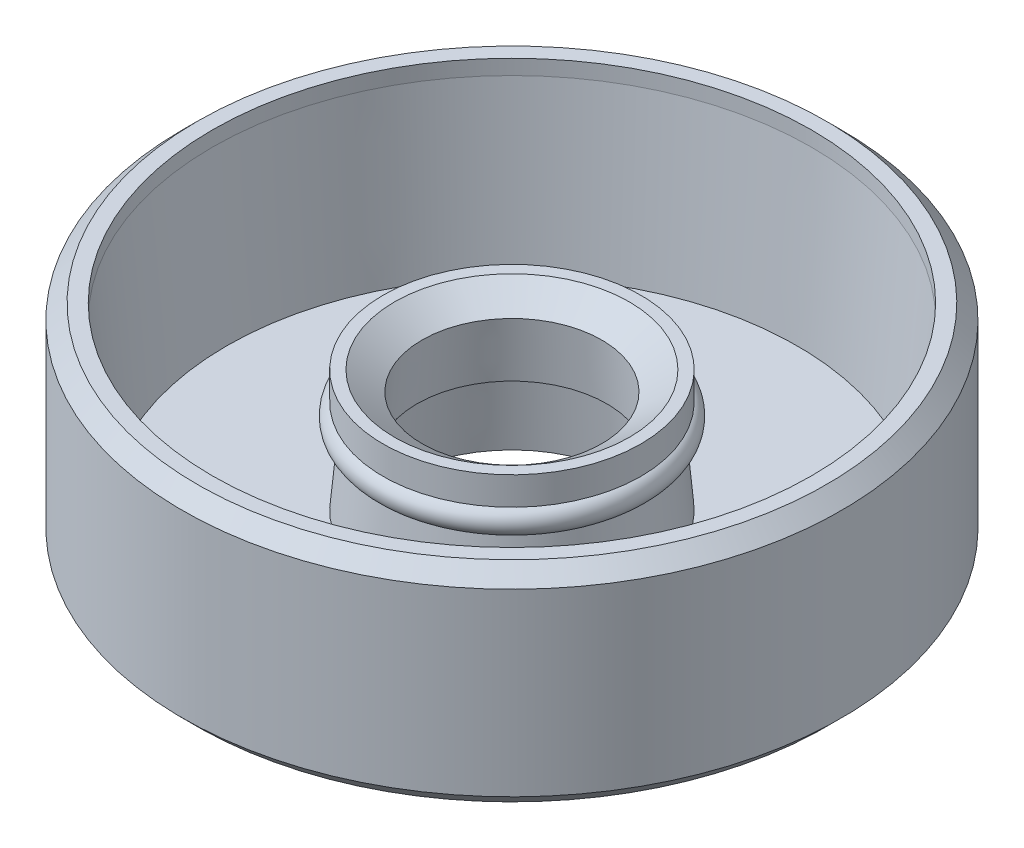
from build123d import *


with BuildPart() as part:
    # Sketch 1 → Revolve 1 (revolve)
    with BuildSketch(Plane.XY):
        with BuildLine():
            Line((-9.518812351, 1), (-4.301871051, 1))
            Line((-4.301871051, 1), (-4.101871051, 3.286010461))
            ThreePointArc((-4.101871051, 3.286010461), (-4.537121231, 3.630475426), (-4.301871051, 4.133224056))
            Line((-4.301871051, 4.133224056), (-4.301871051, 5.071428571))
            Line((-4.301871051, 5.071428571), (-3.918095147, 5.071428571))
            Line((-3.918095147, 5.071428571), (-3, 4.428571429))
            Line((-3, 4.428571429), (-3.168728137, 2.5))
            Line((-3.168728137, 2.5), (-3.668728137, 2.5))
            Line((-3.668728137, 2.5), (-3.887449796, 0))
            Line((-3.887449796, 0), (-10.5, 0))
            Line((-10.5, 0), (-11, 0.5))
            Line((-11, 0.5), (-11, 6.5))
            Line((-11, 6.5), (-10.5, 7))
            Line((-10.5, 7), (-10, 7))
            Line((-10, 7), (-10, 6.5))
            Line((-10, 6.5), (-9.518812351, 1))
        make_face()
    revolve(axis=Axis((0, 5.836193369, 0), (0, -1, 0)))


solid = part.part
